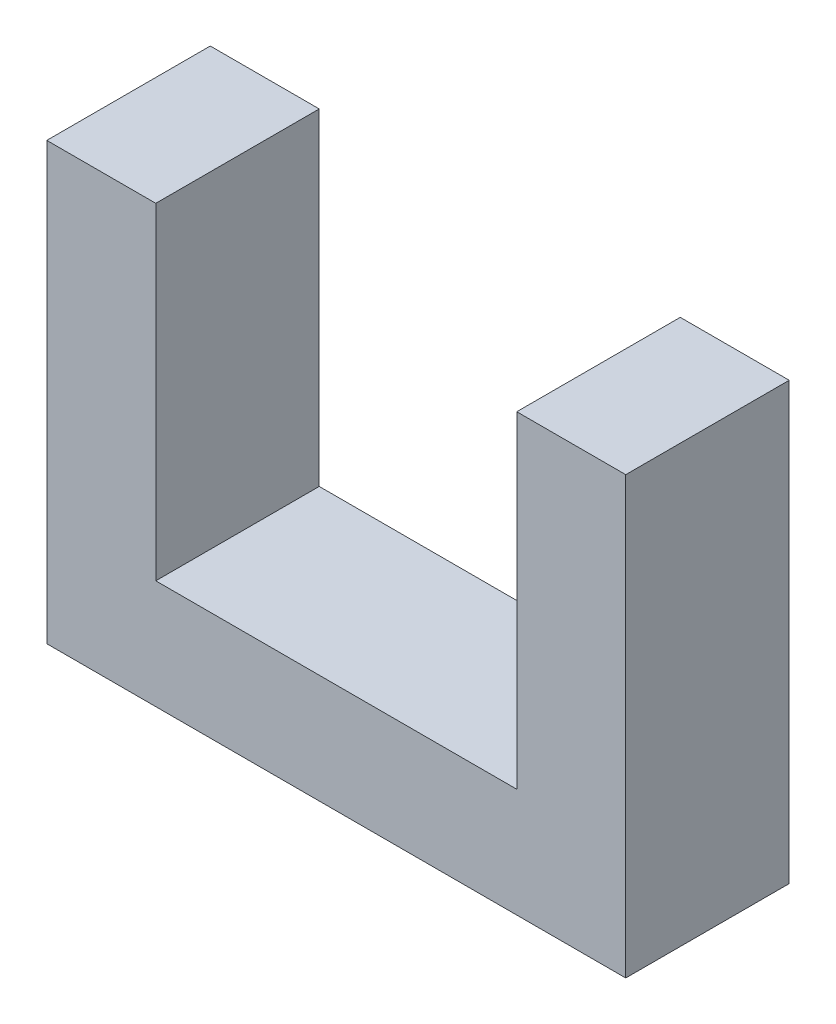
ISO-10303-21;
HEADER;
FILE_DESCRIPTION(('STEP AP214'),'2;1');
FILE_NAME('part.step','',(''),(''),'','','');
FILE_SCHEMA(('AUTOMOTIVE_DESIGN { 1 0 10303 214 1 1 1 1 }'));
ENDSEC;
DATA;
#1=APPLICATION_CONTEXT('core data for automotive mechanical design processes');
#2=APPLICATION_PROTOCOL_DEFINITION('international standard','automotive_design',2000,#1);
#3=PRODUCT_CONTEXT('',#1,'mechanical');
#4=PRODUCT('Part','Part','',(#3));
#5=PRODUCT_RELATED_PRODUCT_CATEGORY('part','',(#4));
#6=PRODUCT_DEFINITION_FORMATION('','',#4);
#7=PRODUCT_DEFINITION_CONTEXT('part definition',#1,'design');
#8=PRODUCT_DEFINITION('design','',#6,#7);
#9=PRODUCT_DEFINITION_SHAPE('','',#8);
#10=(LENGTH_UNIT() NAMED_UNIT(*) SI_UNIT(.MILLI.,.METRE.));
#11=(NAMED_UNIT(*) PLANE_ANGLE_UNIT() SI_UNIT($,.RADIAN.));
#12=(NAMED_UNIT(*) SI_UNIT($,.STERADIAN.) SOLID_ANGLE_UNIT());
#13=UNCERTAINTY_MEASURE_WITH_UNIT(LENGTH_MEASURE(1.E-05),#10,'distance_accuracy_value','');
#14=(GEOMETRIC_REPRESENTATION_CONTEXT(3) GLOBAL_UNCERTAINTY_ASSIGNED_CONTEXT((#13)) GLOBAL_UNIT_ASSIGNED_CONTEXT((#10,
#11,#12)) REPRESENTATION_CONTEXT('',''));
#15=CARTESIAN_POINT('',(0.,0.,0.));
#16=DIRECTION('',(0.,0.,1.));
#17=DIRECTION('',(1.,0.,0.));
#18=AXIS2_PLACEMENT_3D('',#15,#16,#17);
#19=CARTESIAN_POINT('',(-13.25,24.,12.));
#20=DIRECTION('',(0.,-1.,0.));
#21=DIRECTION('',(1.,0.,0.));
#22=AXIS2_PLACEMENT_3D('',#19,#20,#21);
#23=PLANE('',#22);
#24=DIRECTION('',(-1.,0.,0.));
#25=VECTOR('',#24,1.);
#26=CARTESIAN_POINT('',(-13.25,24.,0.));
#27=LINE('',#26,#25);
#28=CARTESIAN_POINT('',(-13.25,24.,0.));
#29=VERTEX_POINT('',#28);
#30=CARTESIAN_POINT('',(-21.25,24.,0.));
#31=VERTEX_POINT('',#30);
#32=EDGE_CURVE('E171',#29,#31,#27,.T.);
#33=ORIENTED_EDGE('',*,*,#32,.T.);
#34=DIRECTION('',(0.,0.,-1.));
#35=VECTOR('',#34,1.);
#36=CARTESIAN_POINT('',(-21.25,24.,12.));
#37=LINE('',#36,#35);
#38=CARTESIAN_POINT('',(-21.25,24.,12.));
#39=VERTEX_POINT('',#38);
#40=EDGE_CURVE('E11',#39,#31,#37,.T.);
#41=ORIENTED_EDGE('',*,*,#40,.F.);
#42=DIRECTION('',(-1.,0.,0.));
#43=VECTOR('',#42,1.);
#44=CARTESIAN_POINT('',(-13.25,24.,12.));
#45=LINE('',#44,#43);
#46=CARTESIAN_POINT('',(-13.25,24.,12.));
#47=VERTEX_POINT('',#46);
#48=EDGE_CURVE('E192',#47,#39,#45,.T.);
#49=ORIENTED_EDGE('',*,*,#48,.F.);
#50=DIRECTION('',(0.,0.,-1.));
#51=VECTOR('',#50,1.);
#52=CARTESIAN_POINT('',(-13.25,24.,12.));
#53=LINE('',#52,#51);
#54=EDGE_CURVE('E167',#47,#29,#53,.T.);
#55=ORIENTED_EDGE('',*,*,#54,.T.);
#56=EDGE_LOOP('',(#33,#41,#49,#55));
#57=FACE_BOUND('',#56,.T.);
#58=ADVANCED_FACE('F41',(#57),#23,.F.);
#59=CARTESIAN_POINT('',(-21.25,24.,12.));
#60=DIRECTION('',(1.,0.,0.));
#61=DIRECTION('',(0.,1.,0.));
#62=AXIS2_PLACEMENT_3D('',#59,#60,#61);
#63=PLANE('',#62);
#64=DIRECTION('',(0.,-1.,0.));
#65=VECTOR('',#64,1.);
#66=CARTESIAN_POINT('',(-21.25,24.,0.));
#67=LINE('',#66,#65);
#68=CARTESIAN_POINT('',(-21.25,-8.,0.));
#69=VERTEX_POINT('',#68);
#70=EDGE_CURVE('E174',#31,#69,#67,.T.);
#71=ORIENTED_EDGE('',*,*,#70,.T.);
#72=DIRECTION('',(0.,0.,-1.));
#73=VECTOR('',#72,1.);
#74=CARTESIAN_POINT('',(-21.25,-8.,12.));
#75=LINE('',#74,#73);
#76=CARTESIAN_POINT('',(-21.25,-8.,12.));
#77=VERTEX_POINT('',#76);
#78=EDGE_CURVE('E50',#77,#69,#75,.T.);
#79=ORIENTED_EDGE('',*,*,#78,.F.);
#80=DIRECTION('',(0.,-1.,0.));
#81=VECTOR('',#80,1.);
#82=CARTESIAN_POINT('',(-21.25,24.,12.));
#83=LINE('',#82,#81);
#84=EDGE_CURVE('E122',#39,#77,#83,.T.);
#85=ORIENTED_EDGE('',*,*,#84,.F.);
#86=ORIENTED_EDGE('',*,*,#40,.T.);
#87=EDGE_LOOP('',(#71,#79,#85,#86));
#88=FACE_BOUND('',#87,.T.);
#89=ADVANCED_FACE('F244',(#88),#63,.F.);
#90=CARTESIAN_POINT('',(-21.25,-8.,12.));
#91=DIRECTION('',(0.,1.,0.));
#92=DIRECTION('',(-1.,0.,0.));
#93=AXIS2_PLACEMENT_3D('',#90,#91,#92);
#94=PLANE('',#93);
#95=DIRECTION('',(1.,0.,0.));
#96=VECTOR('',#95,1.);
#97=CARTESIAN_POINT('',(-21.25,-8.,0.));
#98=LINE('',#97,#96);
#99=CARTESIAN_POINT('',(21.25,-8.,0.));
#100=VERTEX_POINT('',#99);
#101=EDGE_CURVE('E177',#69,#100,#98,.T.);
#102=ORIENTED_EDGE('',*,*,#101,.T.);
#103=DIRECTION('',(0.,0.,-1.));
#104=VECTOR('',#103,1.);
#105=CARTESIAN_POINT('',(21.25,-8.,12.));
#106=LINE('',#105,#104);
#107=CARTESIAN_POINT('',(21.25,-8.,12.));
#108=VERTEX_POINT('',#107);
#109=EDGE_CURVE('E203',#108,#100,#106,.T.);
#110=ORIENTED_EDGE('',*,*,#109,.F.);
#111=DIRECTION('',(1.,0.,0.));
#112=VECTOR('',#111,1.);
#113=CARTESIAN_POINT('',(-21.25,-8.,12.));
#114=LINE('',#113,#112);
#115=EDGE_CURVE('E215',#77,#108,#114,.T.);
#116=ORIENTED_EDGE('',*,*,#115,.F.);
#117=ORIENTED_EDGE('',*,*,#78,.T.);
#118=EDGE_LOOP('',(#102,#110,#116,#117));
#119=FACE_BOUND('',#118,.T.);
#120=ADVANCED_FACE('F213',(#119),#94,.F.);
#121=CARTESIAN_POINT('',(21.25,-8.,12.));
#122=DIRECTION('',(-1.,0.,0.));
#123=DIRECTION('',(0.,0.,1.));
#124=AXIS2_PLACEMENT_3D('',#121,#122,#123);
#125=PLANE('',#124);
#126=DIRECTION('',(0.,1.,0.));
#127=VECTOR('',#126,1.);
#128=CARTESIAN_POINT('',(21.25,-8.,0.));
#129=LINE('',#128,#127);
#130=CARTESIAN_POINT('',(21.25,24.,0.));
#131=VERTEX_POINT('',#130);
#132=EDGE_CURVE('E180',#100,#131,#129,.T.);
#133=ORIENTED_EDGE('',*,*,#132,.T.);
#134=DIRECTION('',(0.,0.,-1.));
#135=VECTOR('',#134,1.);
#136=CARTESIAN_POINT('',(21.25,24.,12.));
#137=LINE('',#136,#135);
#138=CARTESIAN_POINT('',(21.25,24.,12.));
#139=VERTEX_POINT('',#138);
#140=EDGE_CURVE('E199',#139,#131,#137,.T.);
#141=ORIENTED_EDGE('',*,*,#140,.F.);
#142=DIRECTION('',(0.,1.,0.));
#143=VECTOR('',#142,1.);
#144=CARTESIAN_POINT('',(21.25,-8.,12.));
#145=LINE('',#144,#143);
#146=EDGE_CURVE('E228',#108,#139,#145,.T.);
#147=ORIENTED_EDGE('',*,*,#146,.F.);
#148=ORIENTED_EDGE('',*,*,#109,.T.);
#149=EDGE_LOOP('',(#133,#141,#147,#148));
#150=FACE_BOUND('',#149,.T.);
#151=ADVANCED_FACE('F223',(#150),#125,.F.);
#152=CARTESIAN_POINT('',(21.25,24.,12.));
#153=DIRECTION('',(0.,-1.,0.));
#154=DIRECTION('',(1.,0.,0.));
#155=AXIS2_PLACEMENT_3D('',#152,#153,#154);
#156=PLANE('',#155);
#157=DIRECTION('',(-1.,0.,0.));
#158=VECTOR('',#157,1.);
#159=CARTESIAN_POINT('',(21.25,24.,0.));
#160=LINE('',#159,#158);
#161=CARTESIAN_POINT('',(13.25,24.,0.));
#162=VERTEX_POINT('',#161);
#163=EDGE_CURVE('E183',#131,#162,#160,.T.);
#164=ORIENTED_EDGE('',*,*,#163,.T.);
#165=DIRECTION('',(0.,0.,-1.));
#166=VECTOR('',#165,1.);
#167=CARTESIAN_POINT('',(13.25,24.,12.));
#168=LINE('',#167,#166);
#169=CARTESIAN_POINT('',(13.25,24.,12.));
#170=VERTEX_POINT('',#169);
#171=EDGE_CURVE('E158',#170,#162,#168,.T.);
#172=ORIENTED_EDGE('',*,*,#171,.F.);
#173=DIRECTION('',(-1.,0.,0.));
#174=VECTOR('',#173,1.);
#175=CARTESIAN_POINT('',(21.25,24.,12.));
#176=LINE('',#175,#174);
#177=EDGE_CURVE('E147',#139,#170,#176,.T.);
#178=ORIENTED_EDGE('',*,*,#177,.F.);
#179=ORIENTED_EDGE('',*,*,#140,.T.);
#180=EDGE_LOOP('',(#164,#172,#178,#179));
#181=FACE_BOUND('',#180,.T.);
#182=ADVANCED_FACE('F226',(#181),#156,.F.);
#183=CARTESIAN_POINT('',(13.25,24.,12.));
#184=DIRECTION('',(1.,0.,0.));
#185=DIRECTION('',(0.,0.,-1.));
#186=AXIS2_PLACEMENT_3D('',#183,#184,#185);
#187=PLANE('',#186);
#188=DIRECTION('',(0.,-1.,0.));
#189=VECTOR('',#188,1.);
#190=CARTESIAN_POINT('',(13.25,24.,0.));
#191=LINE('',#190,#189);
#192=CARTESIAN_POINT('',(13.25,0.,0.));
#193=VERTEX_POINT('',#192);
#194=EDGE_CURVE('E156',#162,#193,#191,.T.);
#195=ORIENTED_EDGE('',*,*,#194,.T.);
#196=DIRECTION('',(0.,0.,-1.));
#197=VECTOR('',#196,1.);
#198=CARTESIAN_POINT('',(13.25,0.,12.));
#199=LINE('',#198,#197);
#200=CARTESIAN_POINT('',(13.25,0.,12.));
#201=VERTEX_POINT('',#200);
#202=EDGE_CURVE('E153',#201,#193,#199,.T.);
#203=ORIENTED_EDGE('',*,*,#202,.F.);
#204=DIRECTION('',(0.,-1.,0.));
#205=VECTOR('',#204,1.);
#206=CARTESIAN_POINT('',(13.25,24.,12.));
#207=LINE('',#206,#205);
#208=EDGE_CURVE('E141',#170,#201,#207,.T.);
#209=ORIENTED_EDGE('',*,*,#208,.F.);
#210=ORIENTED_EDGE('',*,*,#171,.T.);
#211=EDGE_LOOP('',(#195,#203,#209,#210));
#212=FACE_BOUND('',#211,.T.);
#213=ADVANCED_FACE('F154',(#212),#187,.F.);
#214=CARTESIAN_POINT('',(13.25,0.,12.));
#215=DIRECTION('',(0.,-1.,0.));
#216=DIRECTION('',(0.,0.,-1.));
#217=AXIS2_PLACEMENT_3D('',#214,#215,#216);
#218=PLANE('',#217);
#219=DIRECTION('',(-1.,0.,0.));
#220=VECTOR('',#219,1.);
#221=CARTESIAN_POINT('',(13.25,0.,0.));
#222=LINE('',#221,#220);
#223=CARTESIAN_POINT('',(-13.25,0.,0.));
#224=VERTEX_POINT('',#223);
#225=EDGE_CURVE('E102',#193,#224,#222,.T.);
#226=ORIENTED_EDGE('',*,*,#225,.T.);
#227=DIRECTION('',(0.,0.,-1.));
#228=VECTOR('',#227,1.);
#229=CARTESIAN_POINT('',(-13.25,0.,12.));
#230=LINE('',#229,#228);
#231=CARTESIAN_POINT('',(-13.25,0.,12.));
#232=VERTEX_POINT('',#231);
#233=EDGE_CURVE('E159',#232,#224,#230,.T.);
#234=ORIENTED_EDGE('',*,*,#233,.F.);
#235=DIRECTION('',(-1.,0.,0.));
#236=VECTOR('',#235,1.);
#237=CARTESIAN_POINT('',(13.25,0.,12.));
#238=LINE('',#237,#236);
#239=EDGE_CURVE('E145',#201,#232,#238,.T.);
#240=ORIENTED_EDGE('',*,*,#239,.F.);
#241=ORIENTED_EDGE('',*,*,#202,.T.);
#242=EDGE_LOOP('',(#226,#234,#240,#241));
#243=FACE_BOUND('',#242,.T.);
#244=ADVANCED_FACE('F161',(#243),#218,.F.);
#245=CARTESIAN_POINT('',(-13.25,0.,12.));
#246=DIRECTION('',(-1.,0.,0.));
#247=DIRECTION('',(0.,0.,1.));
#248=AXIS2_PLACEMENT_3D('',#245,#246,#247);
#249=PLANE('',#248);
#250=DIRECTION('',(0.,1.,0.));
#251=VECTOR('',#250,1.);
#252=CARTESIAN_POINT('',(-13.25,0.,0.));
#253=LINE('',#252,#251);
#254=EDGE_CURVE('E111',#224,#29,#253,.T.);
#255=ORIENTED_EDGE('',*,*,#254,.T.);
#256=ORIENTED_EDGE('',*,*,#54,.F.);
#257=DIRECTION('',(0.,1.,0.));
#258=VECTOR('',#257,1.);
#259=CARTESIAN_POINT('',(-13.25,0.,12.));
#260=LINE('',#259,#258);
#261=EDGE_CURVE('E63',#232,#47,#260,.T.);
#262=ORIENTED_EDGE('',*,*,#261,.F.);
#263=ORIENTED_EDGE('',*,*,#233,.T.);
#264=EDGE_LOOP('',(#255,#256,#262,#263));
#265=FACE_BOUND('',#264,.T.);
#266=ADVANCED_FACE('F260',(#265),#249,.F.);
#267=CARTESIAN_POINT('',(0.,0.,12.));
#268=DIRECTION('',(0.,0.,1.));
#269=DIRECTION('',(1.,0.,0.));
#270=AXIS2_PLACEMENT_3D('',#267,#268,#269);
#271=PLANE('',#270);
#272=ORIENTED_EDGE('',*,*,#48,.T.);
#273=ORIENTED_EDGE('',*,*,#84,.T.);
#274=ORIENTED_EDGE('',*,*,#115,.T.);
#275=ORIENTED_EDGE('',*,*,#146,.T.);
#276=ORIENTED_EDGE('',*,*,#177,.T.);
#277=ORIENTED_EDGE('',*,*,#208,.T.);
#278=ORIENTED_EDGE('',*,*,#239,.T.);
#279=ORIENTED_EDGE('',*,*,#261,.T.);
#280=EDGE_LOOP('',(#272,#273,#274,#275,#276,#277,#278,#279));
#281=FACE_BOUND('',#280,.T.);
#282=ADVANCED_FACE('F143',(#281),#271,.T.);
#283=CARTESIAN_POINT('',(0.,0.,0.));
#284=DIRECTION('',(0.,0.,1.));
#285=DIRECTION('',(1.,0.,0.));
#286=AXIS2_PLACEMENT_3D('',#283,#284,#285);
#287=PLANE('',#286);
#288=ORIENTED_EDGE('',*,*,#32,.F.);
#289=ORIENTED_EDGE('',*,*,#254,.F.);
#290=ORIENTED_EDGE('',*,*,#225,.F.);
#291=ORIENTED_EDGE('',*,*,#194,.F.);
#292=ORIENTED_EDGE('',*,*,#163,.F.);
#293=ORIENTED_EDGE('',*,*,#132,.F.);
#294=ORIENTED_EDGE('',*,*,#101,.F.);
#295=ORIENTED_EDGE('',*,*,#70,.F.);
#296=EDGE_LOOP('',(#288,#289,#290,#291,#292,#293,#294,#295));
#297=FACE_BOUND('',#296,.T.);
#298=ADVANCED_FACE('F219',(#297),#287,.F.);
#299=CLOSED_SHELL('',(#58,#89,#120,#151,#182,#213,#244,#266,#282,#298));
#300=MANIFOLD_SOLID_BREP('B2',#299);
#301=ADVANCED_BREP_SHAPE_REPRESENTATION('',(#18,#300),#14);
#302=SHAPE_DEFINITION_REPRESENTATION(#9,#301);
ENDSEC;
END-ISO-10303-21;
